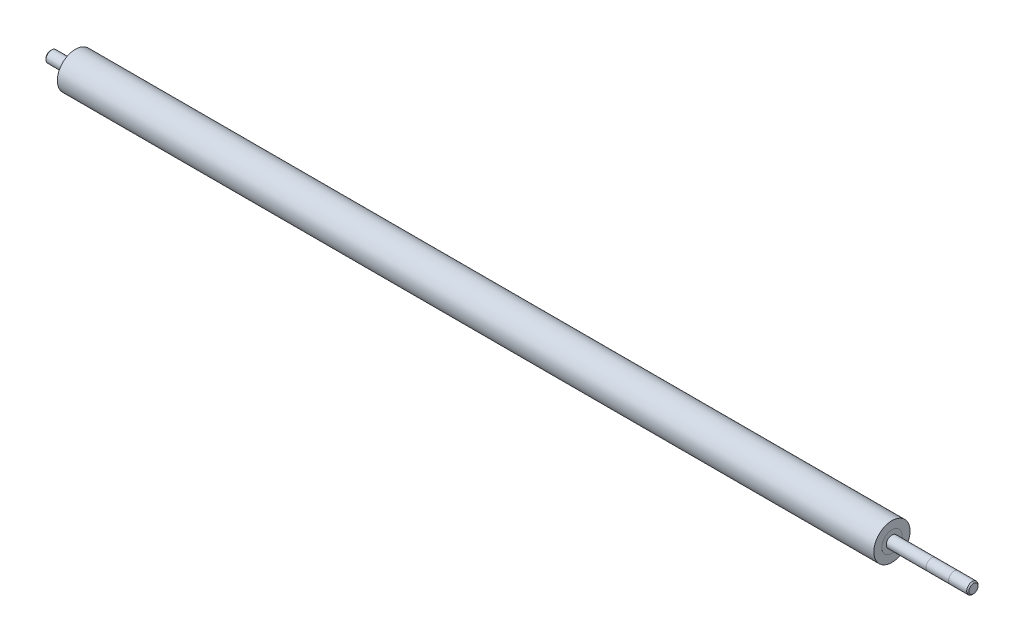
ISO-10303-21;
HEADER;
FILE_DESCRIPTION(('STEP AP214'),'2;1');
FILE_NAME('part.step','',(''),(''),'','','');
FILE_SCHEMA(('AUTOMOTIVE_DESIGN { 1 0 10303 214 1 1 1 1 }'));
ENDSEC;
DATA;
#1=APPLICATION_CONTEXT('core data for automotive mechanical design processes');
#2=APPLICATION_PROTOCOL_DEFINITION('international standard','automotive_design',2000,#1);
#3=PRODUCT_CONTEXT('',#1,'mechanical');
#4=PRODUCT('Part','Part','',(#3));
#5=PRODUCT_RELATED_PRODUCT_CATEGORY('part','',(#4));
#6=PRODUCT_DEFINITION_FORMATION('','',#4);
#7=PRODUCT_DEFINITION_CONTEXT('part definition',#1,'design');
#8=PRODUCT_DEFINITION('design','',#6,#7);
#9=PRODUCT_DEFINITION_SHAPE('','',#8);
#10=(LENGTH_UNIT() NAMED_UNIT(*) SI_UNIT(.MILLI.,.METRE.));
#11=(NAMED_UNIT(*) PLANE_ANGLE_UNIT() SI_UNIT($,.RADIAN.));
#12=(NAMED_UNIT(*) SI_UNIT($,.STERADIAN.) SOLID_ANGLE_UNIT());
#13=UNCERTAINTY_MEASURE_WITH_UNIT(LENGTH_MEASURE(1.E-05),#10,'distance_accuracy_value','');
#14=(GEOMETRIC_REPRESENTATION_CONTEXT(3) GLOBAL_UNCERTAINTY_ASSIGNED_CONTEXT((#13)) GLOBAL_UNIT_ASSIGNED_CONTEXT((#10,
#11,#12)) REPRESENTATION_CONTEXT('',''));
#15=CARTESIAN_POINT('',(0.,0.,0.));
#16=DIRECTION('',(0.,0.,1.));
#17=DIRECTION('',(1.,0.,0.));
#18=AXIS2_PLACEMENT_3D('',#15,#16,#17);
#19=CARTESIAN_POINT('',(-382.5,0.,0.));
#20=DIRECTION('',(1.,0.,0.));
#21=DIRECTION('',(0.,1.,0.));
#22=AXIS2_PLACEMENT_3D('',#19,#20,#21);
#23=CYLINDRICAL_SURFACE('',#22,5.);
#24=CARTESIAN_POINT('',(-381.5,0.,0.));
#25=DIRECTION('',(-1.,0.,0.));
#26=DIRECTION('',(0.,-1.,0.));
#27=AXIS2_PLACEMENT_3D('',#24,#25,#26);
#28=CIRCLE('',#27,5.);
#29=CARTESIAN_POINT('',(-381.5,-4.99999999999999,0.));
#30=VERTEX_POINT('',#29);
#31=EDGE_CURVE('E13',#30,#30,#28,.F.);
#32=ORIENTED_EDGE('',*,*,#31,.T.);
#33=EDGE_LOOP('',(#32));
#34=FACE_BOUND('',#33,.T.);
#35=CARTESIAN_POINT('',(-323.,0.,0.));
#36=DIRECTION('',(-1.,0.,0.));
#37=DIRECTION('',(0.,-1.,0.));
#38=AXIS2_PLACEMENT_3D('',#35,#36,#37);
#39=CIRCLE('',#38,5.);
#40=CARTESIAN_POINT('',(-323.,-5.,0.));
#41=VERTEX_POINT('',#40);
#42=EDGE_CURVE('E65',#41,#41,#39,.T.);
#43=ORIENTED_EDGE('',*,*,#42,.T.);
#44=EDGE_LOOP('',(#43));
#45=FACE_BOUND('',#44,.T.);
#46=ADVANCED_FACE('F54',(#34,#45),#23,.T.);
#47=CARTESIAN_POINT('',(-382.5,0.,0.));
#48=DIRECTION('',(-1.,0.,0.));
#49=DIRECTION('',(0.,-1.,0.));
#50=AXIS2_PLACEMENT_3D('',#47,#48,#49);
#51=PLANE('',#50);
#52=CARTESIAN_POINT('',(-382.5,0.,0.));
#53=DIRECTION('',(-1.,0.,0.));
#54=DIRECTION('',(0.,-1.,0.));
#55=AXIS2_PLACEMENT_3D('',#52,#53,#54);
#56=CIRCLE('',#55,4.00000000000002);
#57=CARTESIAN_POINT('',(-382.5,-4.00000000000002,0.));
#58=VERTEX_POINT('',#57);
#59=EDGE_CURVE('E61',#58,#58,#56,.T.);
#60=ORIENTED_EDGE('',*,*,#59,.T.);
#61=EDGE_LOOP('',(#60));
#62=FACE_BOUND('',#61,.T.);
#63=ADVANCED_FACE('F85',(#62),#51,.T.);
#64=CARTESIAN_POINT('',(-322.5,3.,0.));
#65=DIRECTION('',(-1.,0.,0.));
#66=DIRECTION('',(0.,1.,0.));
#67=AXIS2_PLACEMENT_3D('',#64,#65,#66);
#68=PLANE('',#67);
#69=CARTESIAN_POINT('',(-322.5,0.,0.));
#70=DIRECTION('',(-1.,0.,0.));
#71=DIRECTION('',(0.,-1.,0.));
#72=AXIS2_PLACEMENT_3D('',#69,#70,#71);
#73=CIRCLE('',#72,4.50000000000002);
#74=CARTESIAN_POINT('',(-322.5,-4.50000000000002,0.));
#75=VERTEX_POINT('',#74);
#76=EDGE_CURVE('E69',#75,#75,#73,.F.);
#77=ORIENTED_EDGE('',*,*,#76,.T.);
#78=EDGE_LOOP('',(#77));
#79=FACE_BOUND('',#78,.T.);
#80=ADVANCED_FACE('F75',(#79),#68,.F.);
#81=CARTESIAN_POINT('',(-322.5,0.,0.));
#82=DIRECTION('',(-1.,0.,0.));
#83=DIRECTION('',(0.,-1.,0.));
#84=AXIS2_PLACEMENT_3D('',#81,#82,#83);
#85=CONICAL_SURFACE('',#84,4.50000000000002,0.785398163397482);
#86=ORIENTED_EDGE('',*,*,#42,.F.);
#87=EDGE_LOOP('',(#86));
#88=FACE_BOUND('',#87,.T.);
#89=ORIENTED_EDGE('',*,*,#76,.F.);
#90=EDGE_LOOP('',(#89));
#91=FACE_BOUND('',#90,.T.);
#92=ADVANCED_FACE('F77',(#88,#91),#85,.T.);
#93=CARTESIAN_POINT('',(-382.5,0.,0.));
#94=DIRECTION('',(1.,0.,0.));
#95=DIRECTION('',(0.,1.,0.));
#96=AXIS2_PLACEMENT_3D('',#93,#94,#95);
#97=CONICAL_SURFACE('',#96,4.00000000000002,0.785398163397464);
#98=ORIENTED_EDGE('',*,*,#31,.F.);
#99=EDGE_LOOP('',(#98));
#100=FACE_BOUND('',#99,.T.);
#101=ORIENTED_EDGE('',*,*,#59,.F.);
#102=EDGE_LOOP('',(#101));
#103=FACE_BOUND('',#102,.T.);
#104=ADVANCED_FACE('F56',(#100,#103),#97,.T.);
#105=CLOSED_SHELL('',(#46,#63,#80,#92,#104));
#106=MANIFOLD_SOLID_BREP('B2',#105);
#107=CARTESIAN_POINT('',(432.5,0.,0.));
#108=DIRECTION('',(-1.,0.,0.));
#109=DIRECTION('',(0.,-1.,0.));
#110=AXIS2_PLACEMENT_3D('',#107,#108,#109);
#111=CYLINDRICAL_SURFACE('',#110,5.);
#112=CARTESIAN_POINT('',(323.,0.,0.));
#113=DIRECTION('',(1.,0.,0.));
#114=DIRECTION('',(0.,1.,0.));
#115=AXIS2_PLACEMENT_3D('',#112,#113,#114);
#116=CIRCLE('',#115,5.);
#117=CARTESIAN_POINT('',(323.,4.99999999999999,0.));
#118=VERTEX_POINT('',#117);
#119=EDGE_CURVE('E151',#118,#118,#116,.T.);
#120=ORIENTED_EDGE('',*,*,#119,.T.);
#121=EDGE_LOOP('',(#120));
#122=FACE_BOUND('',#121,.T.);
#123=CARTESIAN_POINT('',(332.5,0.,0.));
#124=DIRECTION('',(-1.,0.,0.));
#125=DIRECTION('',(0.,-1.,0.));
#126=AXIS2_PLACEMENT_3D('',#123,#124,#125);
#127=CIRCLE('',#126,5.);
#128=CARTESIAN_POINT('',(332.5,-5.,0.));
#129=VERTEX_POINT('',#128);
#130=EDGE_CURVE('E53',#129,#129,#127,.T.);
#131=ORIENTED_EDGE('',*,*,#130,.T.);
#132=EDGE_LOOP('',(#131));
#133=FACE_BOUND('',#132,.T.);
#134=ADVANCED_FACE('F125',(#122,#133),#111,.T.);
#135=ORIENTED_EDGE('',*,*,#130,.F.);
#136=EDGE_LOOP('',(#135));
#137=FACE_BOUND('',#136,.T.);
#138=CARTESIAN_POINT('',(342.5,0.,0.));
#139=DIRECTION('',(-1.,0.,0.));
#140=DIRECTION('',(0.,-1.,0.));
#141=AXIS2_PLACEMENT_3D('',#138,#139,#140);
#142=CIRCLE('',#141,5.);
#143=CARTESIAN_POINT('',(342.5,-5.,0.));
#144=VERTEX_POINT('',#143);
#145=EDGE_CURVE('E132',#144,#144,#142,.T.);
#146=ORIENTED_EDGE('',*,*,#145,.T.);
#147=EDGE_LOOP('',(#146));
#148=FACE_BOUND('',#147,.T.);
#149=ADVANCED_FACE('F173',(#137,#148),#111,.T.);
#150=CARTESIAN_POINT('',(415.5,0.,0.));
#151=DIRECTION('',(1.,0.,0.));
#152=DIRECTION('',(0.,0.,-1.));
#153=AXIS2_PLACEMENT_3D('',#150,#151,#152);
#154=CIRCLE('',#153,5.);
#155=CARTESIAN_POINT('',(415.5,0.,-5.));
#156=VERTEX_POINT('',#155);
#157=EDGE_CURVE('E140',#156,#156,#154,.T.);
#158=ORIENTED_EDGE('',*,*,#157,.F.);
#159=EDGE_LOOP('',(#158));
#160=FACE_BOUND('',#159,.T.);
#161=CARTESIAN_POINT('',(395.5,0.,0.));
#162=DIRECTION('',(1.,0.,0.));
#163=DIRECTION('',(0.,0.,-1.));
#164=AXIS2_PLACEMENT_3D('',#161,#162,#163);
#165=CIRCLE('',#164,5.);
#166=CARTESIAN_POINT('',(395.5,0.,-5.));
#167=VERTEX_POINT('',#166);
#168=EDGE_CURVE('E136',#167,#167,#165,.T.);
#169=ORIENTED_EDGE('',*,*,#168,.T.);
#170=EDGE_LOOP('',(#169));
#171=FACE_BOUND('',#170,.T.);
#172=ADVANCED_FACE('F179',(#160,#171),#111,.T.);
#173=CARTESIAN_POINT('',(431.5,0.,0.));
#174=DIRECTION('',(1.,0.,0.));
#175=DIRECTION('',(0.,1.,0.));
#176=AXIS2_PLACEMENT_3D('',#173,#174,#175);
#177=CIRCLE('',#176,5.);
#178=CARTESIAN_POINT('',(431.5,5.,0.));
#179=VERTEX_POINT('',#178);
#180=EDGE_CURVE('E145',#179,#179,#177,.F.);
#181=ORIENTED_EDGE('',*,*,#180,.T.);
#182=EDGE_LOOP('',(#181));
#183=FACE_BOUND('',#182,.T.);
#184=ORIENTED_EDGE('',*,*,#157,.T.);
#185=EDGE_LOOP('',(#184));
#186=FACE_BOUND('',#185,.T.);
#187=ADVANCED_FACE('F183',(#183,#186),#111,.T.);
#188=ORIENTED_EDGE('',*,*,#145,.F.);
#189=EDGE_LOOP('',(#188));
#190=FACE_BOUND('',#189,.T.);
#191=ORIENTED_EDGE('',*,*,#168,.F.);
#192=EDGE_LOOP('',(#191));
#193=FACE_BOUND('',#192,.T.);
#194=ADVANCED_FACE('F175',(#190,#193),#111,.T.);
#195=CARTESIAN_POINT('',(432.5,0.,0.));
#196=DIRECTION('',(1.,0.,0.));
#197=DIRECTION('',(0.,1.,0.));
#198=AXIS2_PLACEMENT_3D('',#195,#196,#197);
#199=PLANE('',#198);
#200=CARTESIAN_POINT('',(432.5,0.,0.));
#201=DIRECTION('',(1.,0.,0.));
#202=DIRECTION('',(0.,1.,0.));
#203=AXIS2_PLACEMENT_3D('',#200,#201,#202);
#204=CIRCLE('',#203,4.00000000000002);
#205=CARTESIAN_POINT('',(432.5,4.00000000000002,0.));
#206=VERTEX_POINT('',#205);
#207=EDGE_CURVE('E148',#206,#206,#204,.T.);
#208=ORIENTED_EDGE('',*,*,#207,.T.);
#209=EDGE_LOOP('',(#208));
#210=FACE_BOUND('',#209,.T.);
#211=ADVANCED_FACE('F168',(#210),#199,.T.);
#212=CARTESIAN_POINT('',(322.5,3.,0.));
#213=DIRECTION('',(1.,0.,0.));
#214=DIRECTION('',(0.,1.,0.));
#215=AXIS2_PLACEMENT_3D('',#212,#213,#214);
#216=PLANE('',#215);
#217=CARTESIAN_POINT('',(322.5,0.,0.));
#218=DIRECTION('',(1.,0.,0.));
#219=DIRECTION('',(0.,1.,0.));
#220=AXIS2_PLACEMENT_3D('',#217,#218,#219);
#221=CIRCLE('',#220,4.50000000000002);
#222=CARTESIAN_POINT('',(322.5,4.50000000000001,0.));
#223=VERTEX_POINT('',#222);
#224=EDGE_CURVE('E154',#223,#223,#221,.F.);
#225=ORIENTED_EDGE('',*,*,#224,.T.);
#226=EDGE_LOOP('',(#225));
#227=FACE_BOUND('',#226,.T.);
#228=ADVANCED_FACE('F158',(#227),#216,.F.);
#229=CARTESIAN_POINT('',(322.5,0.,0.));
#230=DIRECTION('',(1.,0.,0.));
#231=DIRECTION('',(0.,1.,0.));
#232=AXIS2_PLACEMENT_3D('',#229,#230,#231);
#233=CONICAL_SURFACE('',#232,4.50000000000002,0.785398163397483);
#234=ORIENTED_EDGE('',*,*,#119,.F.);
#235=EDGE_LOOP('',(#234));
#236=FACE_BOUND('',#235,.T.);
#237=ORIENTED_EDGE('',*,*,#224,.F.);
#238=EDGE_LOOP('',(#237));
#239=FACE_BOUND('',#238,.T.);
#240=ADVANCED_FACE('F160',(#236,#239),#233,.T.);
#241=CARTESIAN_POINT('',(432.5,0.,0.));
#242=DIRECTION('',(-1.,0.,0.));
#243=DIRECTION('',(0.,-1.,0.));
#244=AXIS2_PLACEMENT_3D('',#241,#242,#243);
#245=CONICAL_SURFACE('',#244,4.00000000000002,0.785398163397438);
#246=ORIENTED_EDGE('',*,*,#180,.F.);
#247=EDGE_LOOP('',(#246));
#248=FACE_BOUND('',#247,.T.);
#249=ORIENTED_EDGE('',*,*,#207,.F.);
#250=EDGE_LOOP('',(#249));
#251=FACE_BOUND('',#250,.T.);
#252=ADVANCED_FACE('F127',(#248,#251),#245,.T.);
#253=CLOSED_SHELL('',(#134,#149,#172,#187,#194,#211,#228,#240,#252));
#254=MANIFOLD_SOLID_BREP('B8',#253);
#255=CARTESIAN_POINT('',(-298.5,0.,0.));
#256=DIRECTION('',(1.,0.,0.));
#257=DIRECTION('',(0.,-1.,0.));
#258=AXIS2_PLACEMENT_3D('',#255,#256,#257);
#259=PLANE('',#258);
#260=CARTESIAN_POINT('',(-298.5,0.,0.));
#261=DIRECTION('',(1.,0.,0.));
#262=DIRECTION('',(0.,1.,0.));
#263=AXIS2_PLACEMENT_3D('',#260,#261,#262);
#264=CIRCLE('',#263,6.00000000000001);
#265=CARTESIAN_POINT('',(-298.5,6.,0.));
#266=VERTEX_POINT('',#265);
#267=EDGE_CURVE('E123',#266,#266,#264,.T.);
#268=ORIENTED_EDGE('',*,*,#267,.T.);
#269=EDGE_LOOP('',(#268));
#270=FACE_BOUND('',#269,.T.);
#271=ADVANCED_FACE('F260',(#270),#259,.T.);
#272=CARTESIAN_POINT('',(-299.5,0.,0.));
#273=DIRECTION('',(-1.,0.,0.));
#274=DIRECTION('',(0.,1.,0.));
#275=AXIS2_PLACEMENT_3D('',#272,#273,#274);
#276=CONICAL_SURFACE('',#275,7.00000000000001,0.785398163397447);
#277=ORIENTED_EDGE('',*,*,#267,.F.);
#278=EDGE_LOOP('',(#277));
#279=FACE_BOUND('',#278,.T.);
#280=CARTESIAN_POINT('',(-299.5,0.,0.));
#281=DIRECTION('',(1.,0.,0.));
#282=DIRECTION('',(0.,1.,0.));
#283=AXIS2_PLACEMENT_3D('',#280,#281,#282);
#284=CIRCLE('',#283,7.00000000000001);
#285=CARTESIAN_POINT('',(-299.5,7.,0.));
#286=VERTEX_POINT('',#285);
#287=EDGE_CURVE('E266',#286,#286,#284,.T.);
#288=ORIENTED_EDGE('',*,*,#287,.T.);
#289=EDGE_LOOP('',(#288));
#290=FACE_BOUND('',#289,.T.);
#291=ADVANCED_FACE('F282',(#279,#290),#276,.T.);
#292=CARTESIAN_POINT('',(-360.5,0.,0.));
#293=DIRECTION('',(-1.,0.,0.));
#294=DIRECTION('',(0.,1.,0.));
#295=AXIS2_PLACEMENT_3D('',#292,#293,#294);
#296=CYLINDRICAL_SURFACE('',#295,7.00000000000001);
#297=ORIENTED_EDGE('',*,*,#287,.F.);
#298=EDGE_LOOP('',(#297));
#299=FACE_BOUND('',#298,.T.);
#300=CARTESIAN_POINT('',(-318.5,0.,0.));
#301=DIRECTION('',(1.,0.,0.));
#302=DIRECTION('',(0.,1.,0.));
#303=AXIS2_PLACEMENT_3D('',#300,#301,#302);
#304=CIRCLE('',#303,7.);
#305=CARTESIAN_POINT('',(-318.5,7.,0.));
#306=VERTEX_POINT('',#305);
#307=EDGE_CURVE('E294',#306,#306,#304,.T.);
#308=ORIENTED_EDGE('',*,*,#307,.T.);
#309=EDGE_LOOP('',(#308));
#310=FACE_BOUND('',#309,.T.);
#311=ADVANCED_FACE('F287',(#299,#310),#296,.T.);
#312=CARTESIAN_POINT('',(-318.5,7.,0.));
#313=DIRECTION('',(1.,0.,0.));
#314=DIRECTION('',(0.,-1.,0.));
#315=AXIS2_PLACEMENT_3D('',#312,#313,#314);
#316=PLANE('',#315);
#317=ORIENTED_EDGE('',*,*,#307,.F.);
#318=EDGE_LOOP('',(#317));
#319=FACE_BOUND('',#318,.T.);
#320=CARTESIAN_POINT('',(-318.5,0.,0.));
#321=DIRECTION('',(1.,0.,0.));
#322=DIRECTION('',(0.,1.,0.));
#323=AXIS2_PLACEMENT_3D('',#320,#321,#322);
#324=CIRCLE('',#323,9.00000000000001);
#325=CARTESIAN_POINT('',(-318.5,9.,0.));
#326=VERTEX_POINT('',#325);
#327=EDGE_CURVE('E296',#326,#326,#324,.T.);
#328=ORIENTED_EDGE('',*,*,#327,.T.);
#329=EDGE_LOOP('',(#328));
#330=FACE_BOUND('',#329,.T.);
#331=ADVANCED_FACE('F329',(#319,#330),#316,.T.);
#332=CARTESIAN_POINT('',(-360.5,0.,0.));
#333=DIRECTION('',(-1.,0.,0.));
#334=DIRECTION('',(0.,1.,0.));
#335=AXIS2_PLACEMENT_3D('',#332,#333,#334);
#336=CYLINDRICAL_SURFACE('',#335,9.);
#337=ORIENTED_EDGE('',*,*,#327,.F.);
#338=EDGE_LOOP('',(#337));
#339=FACE_BOUND('',#338,.T.);
#340=CARTESIAN_POINT('',(-360.5,0.,0.));
#341=DIRECTION('',(1.,0.,0.));
#342=DIRECTION('',(0.,1.,0.));
#343=AXIS2_PLACEMENT_3D('',#340,#341,#342);
#344=CIRCLE('',#343,9.);
#345=CARTESIAN_POINT('',(-360.5,9.,0.));
#346=VERTEX_POINT('',#345);
#347=EDGE_CURVE('E301',#346,#346,#344,.T.);
#348=ORIENTED_EDGE('',*,*,#347,.T.);
#349=EDGE_LOOP('',(#348));
#350=FACE_BOUND('',#349,.T.);
#351=ADVANCED_FACE('F322',(#339,#350),#336,.T.);
#352=CARTESIAN_POINT('',(-360.5,9.,0.));
#353=DIRECTION('',(-1.,0.,0.));
#354=DIRECTION('',(0.,1.,0.));
#355=AXIS2_PLACEMENT_3D('',#352,#353,#354);
#356=PLANE('',#355);
#357=ORIENTED_EDGE('',*,*,#347,.F.);
#358=EDGE_LOOP('',(#357));
#359=FACE_BOUND('',#358,.T.);
#360=CARTESIAN_POINT('',(-360.5,0.,0.));
#361=DIRECTION('',(1.,0.,0.));
#362=DIRECTION('',(0.,1.,0.));
#363=AXIS2_PLACEMENT_3D('',#360,#361,#362);
#364=CIRCLE('',#363,5.);
#365=CARTESIAN_POINT('',(-360.5,5.,0.));
#366=VERTEX_POINT('',#365);
#367=EDGE_CURVE('E304',#366,#366,#364,.T.);
#368=ORIENTED_EDGE('',*,*,#367,.T.);
#369=EDGE_LOOP('',(#368));
#370=FACE_BOUND('',#369,.T.);
#371=ADVANCED_FACE('F316',(#359,#370),#356,.T.);
#372=CARTESIAN_POINT('',(-360.5,0.,0.));
#373=DIRECTION('',(-1.,0.,0.));
#374=DIRECTION('',(0.,1.,0.));
#375=AXIS2_PLACEMENT_3D('',#372,#373,#374);
#376=CYLINDRICAL_SURFACE('',#375,5.);
#377=ORIENTED_EDGE('',*,*,#367,.F.);
#378=EDGE_LOOP('',(#377));
#379=FACE_BOUND('',#378,.T.);
#380=CARTESIAN_POINT('',(-322.5,0.,0.));
#381=DIRECTION('',(1.,0.,0.));
#382=DIRECTION('',(0.,1.,0.));
#383=AXIS2_PLACEMENT_3D('',#380,#381,#382);
#384=CIRCLE('',#383,5.);
#385=CARTESIAN_POINT('',(-322.5,5.,0.));
#386=VERTEX_POINT('',#385);
#387=EDGE_CURVE('E307',#386,#386,#384,.T.);
#388=ORIENTED_EDGE('',*,*,#387,.T.);
#389=EDGE_LOOP('',(#388));
#390=FACE_BOUND('',#389,.T.);
#391=ADVANCED_FACE('F277',(#379,#390),#376,.F.);
#392=CARTESIAN_POINT('',(-322.5,3.,0.));
#393=DIRECTION('',(-1.,0.,0.));
#394=DIRECTION('',(0.,1.,0.));
#395=AXIS2_PLACEMENT_3D('',#392,#393,#394);
#396=PLANE('',#395);
#397=ORIENTED_EDGE('',*,*,#387,.F.);
#398=EDGE_LOOP('',(#397));
#399=FACE_BOUND('',#398,.T.);
#400=CARTESIAN_POINT('',(-322.5,0.,0.));
#401=DIRECTION('',(1.,0.,0.));
#402=DIRECTION('',(0.,1.,0.));
#403=AXIS2_PLACEMENT_3D('',#400,#401,#402);
#404=CIRCLE('',#403,3.);
#405=CARTESIAN_POINT('',(-322.5,3.,0.));
#406=VERTEX_POINT('',#405);
#407=EDGE_CURVE('E310',#406,#406,#404,.T.);
#408=ORIENTED_EDGE('',*,*,#407,.T.);
#409=EDGE_LOOP('',(#408));
#410=FACE_BOUND('',#409,.T.);
#411=ADVANCED_FACE('F271',(#399,#410),#396,.T.);
#412=CARTESIAN_POINT('',(-320.767949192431,0.,0.));
#413=DIRECTION('',(-1.,0.,0.));
#414=DIRECTION('',(0.,1.,0.));
#415=AXIS2_PLACEMENT_3D('',#412,#413,#414);
#416=CONICAL_SURFACE('',#415,0.,1.0471975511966);
#417=ORIENTED_EDGE('',*,*,#407,.F.);
#418=EDGE_LOOP('',(#417));
#419=FACE_BOUND('',#418,.T.);
#420=CARTESIAN_POINT('',(-320.767949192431,0.,0.));
#421=VERTEX_POINT('',#420);
#422=VERTEX_LOOP('',#421);
#423=FACE_BOUND('',#422,.T.);
#424=ADVANCED_FACE('F269',(#419,#423),#416,.F.);
#425=CLOSED_SHELL('',(#271,#291,#311,#331,#351,#371,#391,#411,#424));
#426=MANIFOLD_SOLID_BREP('B48',#425);
#427=CARTESIAN_POINT('',(298.5,0.,0.));
#428=DIRECTION('',(-1.,0.,0.));
#429=DIRECTION('',(0.,-1.,0.));
#430=AXIS2_PLACEMENT_3D('',#427,#428,#429);
#431=PLANE('',#430);
#432=CARTESIAN_POINT('',(298.5,0.,0.));
#433=DIRECTION('',(1.,0.,0.));
#434=DIRECTION('',(0.,1.,0.));
#435=AXIS2_PLACEMENT_3D('',#432,#433,#434);
#436=CIRCLE('',#435,6.00000000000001);
#437=CARTESIAN_POINT('',(298.5,6.,0.));
#438=VERTEX_POINT('',#437);
#439=EDGE_CURVE('E258',#438,#438,#436,.T.);
#440=ORIENTED_EDGE('',*,*,#439,.F.);
#441=EDGE_LOOP('',(#440));
#442=FACE_BOUND('',#441,.T.);
#443=ADVANCED_FACE('F431',(#442),#431,.T.);
#444=CARTESIAN_POINT('',(299.5,0.,0.));
#445=DIRECTION('',(1.,0.,0.));
#446=DIRECTION('',(0.,1.,0.));
#447=AXIS2_PLACEMENT_3D('',#444,#445,#446);
#448=CONICAL_SURFACE('',#447,7.00000000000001,0.785398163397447);
#449=ORIENTED_EDGE('',*,*,#439,.T.);
#450=EDGE_LOOP('',(#449));
#451=FACE_BOUND('',#450,.T.);
#452=CARTESIAN_POINT('',(299.5,0.,0.));
#453=DIRECTION('',(1.,0.,0.));
#454=DIRECTION('',(0.,1.,0.));
#455=AXIS2_PLACEMENT_3D('',#452,#453,#454);
#456=CIRCLE('',#455,7.00000000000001);
#457=CARTESIAN_POINT('',(299.5,7.,0.));
#458=VERTEX_POINT('',#457);
#459=EDGE_CURVE('E437',#458,#458,#456,.T.);
#460=ORIENTED_EDGE('',*,*,#459,.F.);
#461=EDGE_LOOP('',(#460));
#462=FACE_BOUND('',#461,.T.);
#463=ADVANCED_FACE('F453',(#451,#462),#448,.T.);
#464=CARTESIAN_POINT('',(360.5,0.,0.));
#465=DIRECTION('',(1.,0.,0.));
#466=DIRECTION('',(0.,1.,0.));
#467=AXIS2_PLACEMENT_3D('',#464,#465,#466);
#468=CYLINDRICAL_SURFACE('',#467,7.00000000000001);
#469=ORIENTED_EDGE('',*,*,#459,.T.);
#470=EDGE_LOOP('',(#469));
#471=FACE_BOUND('',#470,.T.);
#472=CARTESIAN_POINT('',(318.5,0.,0.));
#473=DIRECTION('',(1.,0.,0.));
#474=DIRECTION('',(0.,1.,0.));
#475=AXIS2_PLACEMENT_3D('',#472,#473,#474);
#476=CIRCLE('',#475,7.);
#477=CARTESIAN_POINT('',(318.5,7.,0.));
#478=VERTEX_POINT('',#477);
#479=EDGE_CURVE('E465',#478,#478,#476,.T.);
#480=ORIENTED_EDGE('',*,*,#479,.F.);
#481=EDGE_LOOP('',(#480));
#482=FACE_BOUND('',#481,.T.);
#483=ADVANCED_FACE('F458',(#471,#482),#468,.T.);
#484=CARTESIAN_POINT('',(318.5,7.,0.));
#485=DIRECTION('',(-1.,0.,0.));
#486=DIRECTION('',(0.,-1.,0.));
#487=AXIS2_PLACEMENT_3D('',#484,#485,#486);
#488=PLANE('',#487);
#489=ORIENTED_EDGE('',*,*,#479,.T.);
#490=EDGE_LOOP('',(#489));
#491=FACE_BOUND('',#490,.T.);
#492=CARTESIAN_POINT('',(318.5,0.,0.));
#493=DIRECTION('',(1.,0.,0.));
#494=DIRECTION('',(0.,1.,0.));
#495=AXIS2_PLACEMENT_3D('',#492,#493,#494);
#496=CIRCLE('',#495,9.00000000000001);
#497=CARTESIAN_POINT('',(318.5,9.,0.));
#498=VERTEX_POINT('',#497);
#499=EDGE_CURVE('E467',#498,#498,#496,.T.);
#500=ORIENTED_EDGE('',*,*,#499,.F.);
#501=EDGE_LOOP('',(#500));
#502=FACE_BOUND('',#501,.T.);
#503=ADVANCED_FACE('F499',(#491,#502),#488,.T.);
#504=CARTESIAN_POINT('',(360.5,0.,0.));
#505=DIRECTION('',(1.,0.,0.));
#506=DIRECTION('',(0.,1.,0.));
#507=AXIS2_PLACEMENT_3D('',#504,#505,#506);
#508=CYLINDRICAL_SURFACE('',#507,9.);
#509=ORIENTED_EDGE('',*,*,#499,.T.);
#510=EDGE_LOOP('',(#509));
#511=FACE_BOUND('',#510,.T.);
#512=CARTESIAN_POINT('',(360.5,0.,0.));
#513=DIRECTION('',(1.,0.,0.));
#514=DIRECTION('',(0.,1.,0.));
#515=AXIS2_PLACEMENT_3D('',#512,#513,#514);
#516=CIRCLE('',#515,9.);
#517=CARTESIAN_POINT('',(360.5,9.,0.));
#518=VERTEX_POINT('',#517);
#519=EDGE_CURVE('E472',#518,#518,#516,.T.);
#520=ORIENTED_EDGE('',*,*,#519,.F.);
#521=EDGE_LOOP('',(#520));
#522=FACE_BOUND('',#521,.T.);
#523=ADVANCED_FACE('F493',(#511,#522),#508,.T.);
#524=CARTESIAN_POINT('',(360.5,9.,0.));
#525=DIRECTION('',(1.,0.,0.));
#526=DIRECTION('',(0.,1.,0.));
#527=AXIS2_PLACEMENT_3D('',#524,#525,#526);
#528=PLANE('',#527);
#529=ORIENTED_EDGE('',*,*,#519,.T.);
#530=EDGE_LOOP('',(#529));
#531=FACE_BOUND('',#530,.T.);
#532=CARTESIAN_POINT('',(360.5,0.,0.));
#533=DIRECTION('',(1.,0.,0.));
#534=DIRECTION('',(0.,1.,0.));
#535=AXIS2_PLACEMENT_3D('',#532,#533,#534);
#536=CIRCLE('',#535,5.);
#537=CARTESIAN_POINT('',(360.5,5.,0.));
#538=VERTEX_POINT('',#537);
#539=EDGE_CURVE('E475',#538,#538,#536,.T.);
#540=ORIENTED_EDGE('',*,*,#539,.F.);
#541=EDGE_LOOP('',(#540));
#542=FACE_BOUND('',#541,.T.);
#543=ADVANCED_FACE('F487',(#531,#542),#528,.T.);
#544=CARTESIAN_POINT('',(360.5,0.,0.));
#545=DIRECTION('',(1.,0.,0.));
#546=DIRECTION('',(0.,1.,0.));
#547=AXIS2_PLACEMENT_3D('',#544,#545,#546);
#548=CYLINDRICAL_SURFACE('',#547,5.);
#549=ORIENTED_EDGE('',*,*,#539,.T.);
#550=EDGE_LOOP('',(#549));
#551=FACE_BOUND('',#550,.T.);
#552=CARTESIAN_POINT('',(322.5,0.,0.));
#553=DIRECTION('',(1.,0.,0.));
#554=DIRECTION('',(0.,1.,0.));
#555=AXIS2_PLACEMENT_3D('',#552,#553,#554);
#556=CIRCLE('',#555,5.);
#557=CARTESIAN_POINT('',(322.5,5.,0.));
#558=VERTEX_POINT('',#557);
#559=EDGE_CURVE('E478',#558,#558,#556,.T.);
#560=ORIENTED_EDGE('',*,*,#559,.F.);
#561=EDGE_LOOP('',(#560));
#562=FACE_BOUND('',#561,.T.);
#563=ADVANCED_FACE('F448',(#551,#562),#548,.F.);
#564=CARTESIAN_POINT('',(322.5,3.,0.));
#565=DIRECTION('',(1.,0.,0.));
#566=DIRECTION('',(0.,1.,0.));
#567=AXIS2_PLACEMENT_3D('',#564,#565,#566);
#568=PLANE('',#567);
#569=ORIENTED_EDGE('',*,*,#559,.T.);
#570=EDGE_LOOP('',(#569));
#571=FACE_BOUND('',#570,.T.);
#572=CARTESIAN_POINT('',(322.5,0.,0.));
#573=DIRECTION('',(1.,0.,0.));
#574=DIRECTION('',(0.,1.,0.));
#575=AXIS2_PLACEMENT_3D('',#572,#573,#574);
#576=CIRCLE('',#575,3.);
#577=CARTESIAN_POINT('',(322.5,3.,0.));
#578=VERTEX_POINT('',#577);
#579=EDGE_CURVE('E481',#578,#578,#576,.T.);
#580=ORIENTED_EDGE('',*,*,#579,.F.);
#581=EDGE_LOOP('',(#580));
#582=FACE_BOUND('',#581,.T.);
#583=ADVANCED_FACE('F442',(#571,#582),#568,.T.);
#584=CARTESIAN_POINT('',(320.767949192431,0.,0.));
#585=DIRECTION('',(1.,0.,0.));
#586=DIRECTION('',(0.,1.,0.));
#587=AXIS2_PLACEMENT_3D('',#584,#585,#586);
#588=CONICAL_SURFACE('',#587,0.,1.0471975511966);
#589=ORIENTED_EDGE('',*,*,#579,.T.);
#590=EDGE_LOOP('',(#589));
#591=FACE_BOUND('',#590,.T.);
#592=CARTESIAN_POINT('',(320.767949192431,0.,0.));
#593=VERTEX_POINT('',#592);
#594=VERTEX_LOOP('',#593);
#595=FACE_BOUND('',#594,.T.);
#596=ADVANCED_FACE('F440',(#591,#595),#588,.F.);
#597=CLOSED_SHELL('',(#443,#463,#483,#503,#523,#543,#563,#583,#596));
#598=MANIFOLD_SOLID_BREP('B117',#597);
#599=CARTESIAN_POINT('',(315.5,0.,0.));
#600=DIRECTION('',(1.,0.,0.));
#601=DIRECTION('',(0.,0.,-1.));
#602=AXIS2_PLACEMENT_3D('',#599,#600,#601);
#603=PLANE('',#602);
#604=CARTESIAN_POINT('',(315.5,0.,0.));
#605=DIRECTION('',(1.,0.,0.));
#606=DIRECTION('',(0.,0.,-1.));
#607=AXIS2_PLACEMENT_3D('',#604,#605,#606);
#608=CIRCLE('',#607,9.);
#609=CARTESIAN_POINT('',(315.5,0.,-9.));
#610=VERTEX_POINT('',#609);
#611=EDGE_CURVE('E430',#610,#610,#608,.T.);
#612=ORIENTED_EDGE('',*,*,#611,.T.);
#613=EDGE_LOOP('',(#612));
#614=FACE_BOUND('',#613,.T.);
#615=CARTESIAN_POINT('',(315.5,0.,0.));
#616=DIRECTION('',(1.,0.,0.));
#617=DIRECTION('',(0.,0.,-1.));
#618=AXIS2_PLACEMENT_3D('',#615,#616,#617);
#619=CIRCLE('',#618,7.);
#620=CARTESIAN_POINT('',(315.5,0.,-7.));
#621=VERTEX_POINT('',#620);
#622=EDGE_CURVE('E582',#621,#621,#619,.T.);
#623=ORIENTED_EDGE('',*,*,#622,.F.);
#624=EDGE_LOOP('',(#623));
#625=FACE_BOUND('',#624,.T.);
#626=ADVANCED_FACE('F571',(#614,#625),#603,.T.);
#627=CARTESIAN_POINT('',(-315.5,0.,0.));
#628=DIRECTION('',(1.,0.,0.));
#629=DIRECTION('',(0.,0.,-1.));
#630=AXIS2_PLACEMENT_3D('',#627,#628,#629);
#631=PLANE('',#630);
#632=CARTESIAN_POINT('',(-315.5,0.,0.));
#633=DIRECTION('',(1.,0.,0.));
#634=DIRECTION('',(0.,0.,-1.));
#635=AXIS2_PLACEMENT_3D('',#632,#633,#634);
#636=CIRCLE('',#635,9.);
#637=CARTESIAN_POINT('',(-315.5,0.,-9.));
#638=VERTEX_POINT('',#637);
#639=EDGE_CURVE('E575',#638,#638,#636,.T.);
#640=ORIENTED_EDGE('',*,*,#639,.F.);
#641=EDGE_LOOP('',(#640));
#642=FACE_BOUND('',#641,.T.);
#643=CARTESIAN_POINT('',(-315.5,0.,0.));
#644=DIRECTION('',(1.,0.,0.));
#645=DIRECTION('',(0.,0.,-1.));
#646=AXIS2_PLACEMENT_3D('',#643,#644,#645);
#647=CIRCLE('',#646,7.);
#648=CARTESIAN_POINT('',(-315.5,0.,-7.));
#649=VERTEX_POINT('',#648);
#650=EDGE_CURVE('E584',#649,#649,#647,.T.);
#651=ORIENTED_EDGE('',*,*,#650,.T.);
#652=EDGE_LOOP('',(#651));
#653=FACE_BOUND('',#652,.T.);
#654=ADVANCED_FACE('F594',(#642,#653),#631,.F.);
#655=CARTESIAN_POINT('',(315.5,0.,0.));
#656=DIRECTION('',(-1.,0.,0.));
#657=DIRECTION('',(0.,0.,1.));
#658=AXIS2_PLACEMENT_3D('',#655,#656,#657);
#659=CYLINDRICAL_SURFACE('',#658,9.);
#660=ORIENTED_EDGE('',*,*,#611,.F.);
#661=EDGE_LOOP('',(#660));
#662=FACE_BOUND('',#661,.T.);
#663=ORIENTED_EDGE('',*,*,#639,.T.);
#664=EDGE_LOOP('',(#663));
#665=FACE_BOUND('',#664,.T.);
#666=ADVANCED_FACE('F573',(#662,#665),#659,.T.);
#667=CARTESIAN_POINT('',(315.5,0.,0.));
#668=DIRECTION('',(-1.,0.,0.));
#669=DIRECTION('',(0.,0.,1.));
#670=AXIS2_PLACEMENT_3D('',#667,#668,#669);
#671=CYLINDRICAL_SURFACE('',#670,7.);
#672=ORIENTED_EDGE('',*,*,#622,.T.);
#673=EDGE_LOOP('',(#672));
#674=FACE_BOUND('',#673,.T.);
#675=ORIENTED_EDGE('',*,*,#650,.F.);
#676=EDGE_LOOP('',(#675));
#677=FACE_BOUND('',#676,.T.);
#678=ADVANCED_FACE('F590',(#674,#677),#671,.F.);
#679=CLOSED_SHELL('',(#626,#654,#666,#678));
#680=MANIFOLD_SOLID_BREP('B252',#679);
#681=CARTESIAN_POINT('',(360.5,0.,0.));
#682=DIRECTION('',(1.,0.,0.));
#683=DIRECTION('',(0.,0.,-1.));
#684=AXIS2_PLACEMENT_3D('',#681,#682,#683);
#685=PLANE('',#684);
#686=CARTESIAN_POINT('',(360.5,0.,0.));
#687=DIRECTION('',(1.,0.,0.));
#688=DIRECTION('',(0.,0.,-1.));
#689=AXIS2_PLACEMENT_3D('',#686,#687,#688);
#690=CIRCLE('',#689,9.);
#691=CARTESIAN_POINT('',(360.5,0.,-9.));
#692=VERTEX_POINT('',#691);
#693=EDGE_CURVE('E640',#692,#692,#690,.T.);
#694=ORIENTED_EDGE('',*,*,#693,.F.);
#695=EDGE_LOOP('',(#694));
#696=FACE_BOUND('',#695,.T.);
#697=CARTESIAN_POINT('',(360.5,0.,0.));
#698=DIRECTION('',(1.,0.,0.));
#699=DIRECTION('',(0.,0.,-1.));
#700=AXIS2_PLACEMENT_3D('',#697,#698,#699);
#701=CIRCLE('',#700,16.);
#702=CARTESIAN_POINT('',(360.5,0.,-16.));
#703=VERTEX_POINT('',#702);
#704=EDGE_CURVE('E648',#703,#703,#701,.T.);
#705=ORIENTED_EDGE('',*,*,#704,.T.);
#706=EDGE_LOOP('',(#705));
#707=FACE_BOUND('',#706,.T.);
#708=ADVANCED_FACE('F633',(#696,#707),#685,.T.);
#709=CARTESIAN_POINT('',(-360.5,0.,0.));
#710=DIRECTION('',(1.,0.,0.));
#711=DIRECTION('',(0.,0.,-1.));
#712=AXIS2_PLACEMENT_3D('',#709,#710,#711);
#713=PLANE('',#712);
#714=CARTESIAN_POINT('',(-360.5,0.,0.));
#715=DIRECTION('',(1.,0.,0.));
#716=DIRECTION('',(0.,0.,-1.));
#717=AXIS2_PLACEMENT_3D('',#714,#715,#716);
#718=CIRCLE('',#717,9.);
#719=CARTESIAN_POINT('',(-360.5,0.,-9.));
#720=VERTEX_POINT('',#719);
#721=EDGE_CURVE('E570',#720,#720,#718,.T.);
#722=ORIENTED_EDGE('',*,*,#721,.T.);
#723=EDGE_LOOP('',(#722));
#724=FACE_BOUND('',#723,.T.);
#725=CARTESIAN_POINT('',(-360.5,0.,0.));
#726=DIRECTION('',(1.,0.,0.));
#727=DIRECTION('',(0.,0.,-1.));
#728=AXIS2_PLACEMENT_3D('',#725,#726,#727);
#729=CIRCLE('',#728,16.);
#730=CARTESIAN_POINT('',(-360.5,0.,-16.));
#731=VERTEX_POINT('',#730);
#732=EDGE_CURVE('E644',#731,#731,#729,.T.);
#733=ORIENTED_EDGE('',*,*,#732,.F.);
#734=EDGE_LOOP('',(#733));
#735=FACE_BOUND('',#734,.T.);
#736=ADVANCED_FACE('F635',(#724,#735),#713,.F.);
#737=CARTESIAN_POINT('',(-360.5,0.,0.));
#738=DIRECTION('',(1.,0.,0.));
#739=DIRECTION('',(0.,0.,-1.));
#740=AXIS2_PLACEMENT_3D('',#737,#738,#739);
#741=CYLINDRICAL_SURFACE('',#740,9.);
#742=ORIENTED_EDGE('',*,*,#721,.F.);
#743=EDGE_LOOP('',(#742));
#744=FACE_BOUND('',#743,.T.);
#745=ORIENTED_EDGE('',*,*,#693,.T.);
#746=EDGE_LOOP('',(#745));
#747=FACE_BOUND('',#746,.T.);
#748=ADVANCED_FACE('F657',(#744,#747),#741,.F.);
#749=CARTESIAN_POINT('',(-360.5,0.,0.));
#750=DIRECTION('',(1.,0.,0.));
#751=DIRECTION('',(0.,0.,-1.));
#752=AXIS2_PLACEMENT_3D('',#749,#750,#751);
#753=CYLINDRICAL_SURFACE('',#752,16.);
#754=ORIENTED_EDGE('',*,*,#732,.T.);
#755=EDGE_LOOP('',(#754));
#756=FACE_BOUND('',#755,.T.);
#757=ORIENTED_EDGE('',*,*,#704,.F.);
#758=EDGE_LOOP('',(#757));
#759=FACE_BOUND('',#758,.T.);
#760=ADVANCED_FACE('F655',(#756,#759),#753,.T.);
#761=CLOSED_SHELL('',(#708,#736,#748,#760));
#762=MANIFOLD_SOLID_BREP('B425',#761);
#763=ADVANCED_BREP_SHAPE_REPRESENTATION('',(#18,#106,#254,#426,#598,#680,#762),#14);
#764=SHAPE_DEFINITION_REPRESENTATION(#9,#763);
ENDSEC;
END-ISO-10303-21;
